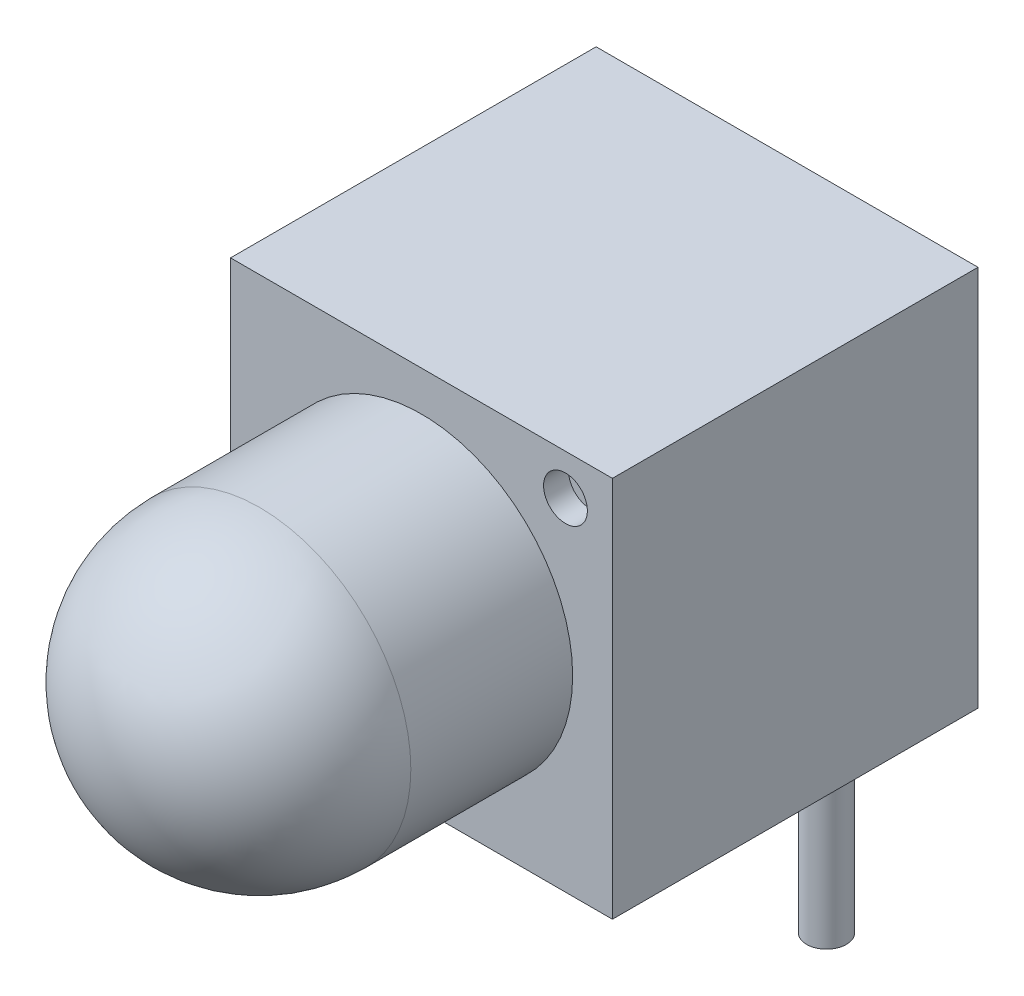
ISO-10303-21;
HEADER;
FILE_DESCRIPTION(('STEP AP214'),'2;1');
FILE_NAME('part.step','',(''),(''),'','','');
FILE_SCHEMA(('AUTOMOTIVE_DESIGN { 1 0 10303 214 1 1 1 1 }'));
ENDSEC;
DATA;
#1=APPLICATION_CONTEXT('core data for automotive mechanical design processes');
#2=APPLICATION_PROTOCOL_DEFINITION('international standard','automotive_design',2000,#1);
#3=PRODUCT_CONTEXT('',#1,'mechanical');
#4=PRODUCT('Part','Part','',(#3));
#5=PRODUCT_RELATED_PRODUCT_CATEGORY('part','',(#4));
#6=PRODUCT_DEFINITION_FORMATION('','',#4);
#7=PRODUCT_DEFINITION_CONTEXT('part definition',#1,'design');
#8=PRODUCT_DEFINITION('design','',#6,#7);
#9=PRODUCT_DEFINITION_SHAPE('','',#8);
#10=(LENGTH_UNIT() NAMED_UNIT(*) SI_UNIT(.MILLI.,.METRE.));
#11=(NAMED_UNIT(*) PLANE_ANGLE_UNIT() SI_UNIT($,.RADIAN.));
#12=(NAMED_UNIT(*) SI_UNIT($,.STERADIAN.) SOLID_ANGLE_UNIT());
#13=UNCERTAINTY_MEASURE_WITH_UNIT(LENGTH_MEASURE(1.E-05),#10,'distance_accuracy_value','');
#14=(GEOMETRIC_REPRESENTATION_CONTEXT(3) GLOBAL_UNCERTAINTY_ASSIGNED_CONTEXT((#13)) GLOBAL_UNIT_ASSIGNED_CONTEXT((#10,
#11,#12)) REPRESENTATION_CONTEXT('',''));
#15=CARTESIAN_POINT('',(0.,0.,0.));
#16=DIRECTION('',(0.,0.,1.));
#17=DIRECTION('',(1.,0.,0.));
#18=AXIS2_PLACEMENT_3D('',#15,#16,#17);
#19=CARTESIAN_POINT('',(-3.05,0.,-5.84));
#20=DIRECTION('',(0.,-1.,0.));
#21=DIRECTION('',(0.,0.,-1.));
#22=AXIS2_PLACEMENT_3D('',#19,#20,#21);
#23=PLANE('',#22);
#24=CARTESIAN_POINT('',(-1.27,0.,-5.2));
#25=DIRECTION('',(0.,-1.,0.));
#26=DIRECTION('',(0.,0.,-1.));
#27=AXIS2_PLACEMENT_3D('',#24,#25,#26);
#28=CIRCLE('',#27,0.3175);
#29=CARTESIAN_POINT('',(-1.27,0.,-5.5175));
#30=VERTEX_POINT('',#29);
#31=EDGE_CURVE('E144',#30,#30,#28,.T.);
#32=ORIENTED_EDGE('',*,*,#31,.F.);
#33=EDGE_LOOP('',(#32));
#34=FACE_BOUND('',#33,.T.);
#35=DIRECTION('',(0.,0.,1.));
#36=VECTOR('',#35,1.);
#37=CARTESIAN_POINT('',(-3.05,0.,0.));
#38=LINE('',#37,#36);
#39=CARTESIAN_POINT('',(-3.05,0.,-5.84));
#40=VERTEX_POINT('',#39);
#41=CARTESIAN_POINT('',(-3.05,0.,0.));
#42=VERTEX_POINT('',#41);
#43=EDGE_CURVE('E111',#40,#42,#38,.T.);
#44=ORIENTED_EDGE('',*,*,#43,.F.);
#45=DIRECTION('',(-1.,0.,0.));
#46=VECTOR('',#45,1.);
#47=CARTESIAN_POINT('',(-3.05,0.,-5.84));
#48=LINE('',#47,#46);
#49=CARTESIAN_POINT('',(3.05,0.,-5.84));
#50=VERTEX_POINT('',#49);
#51=EDGE_CURVE('E78',#50,#40,#48,.T.);
#52=ORIENTED_EDGE('',*,*,#51,.F.);
#53=DIRECTION('',(0.,0.,-1.));
#54=VECTOR('',#53,1.);
#55=CARTESIAN_POINT('',(3.05,0.,0.));
#56=LINE('',#55,#54);
#57=CARTESIAN_POINT('',(3.05,0.,0.));
#58=VERTEX_POINT('',#57);
#59=EDGE_CURVE('E72',#58,#50,#56,.T.);
#60=ORIENTED_EDGE('',*,*,#59,.F.);
#61=DIRECTION('',(1.,0.,0.));
#62=VECTOR('',#61,1.);
#63=CARTESIAN_POINT('',(-3.05,0.,0.));
#64=LINE('',#63,#62);
#65=EDGE_CURVE('E98',#42,#58,#64,.T.);
#66=ORIENTED_EDGE('',*,*,#65,.F.);
#67=EDGE_LOOP('',(#44,#52,#60,#66));
#68=FACE_BOUND('',#67,.T.);
#69=CARTESIAN_POINT('',(1.27,0.,-5.2));
#70=DIRECTION('',(0.,-1.,0.));
#71=DIRECTION('',(0.,0.,1.));
#72=AXIS2_PLACEMENT_3D('',#69,#70,#71);
#73=CIRCLE('',#72,0.3175);
#74=CARTESIAN_POINT('',(1.27,0.,-4.8825));
#75=VERTEX_POINT('',#74);
#76=EDGE_CURVE('E135',#75,#75,#73,.T.);
#77=ORIENTED_EDGE('',*,*,#76,.F.);
#78=EDGE_LOOP('',(#77));
#79=FACE_BOUND('',#78,.T.);
#80=ADVANCED_FACE('F37',(#34,#68,#79),#23,.T.);
#81=CARTESIAN_POINT('',(-3.05,6.1,0.));
#82=DIRECTION('',(0.,0.,-1.));
#83=DIRECTION('',(-1.,0.,0.));
#84=AXIS2_PLACEMENT_3D('',#81,#82,#83);
#85=PLANE('',#84);
#86=CARTESIAN_POINT('',(2.3,5.45,0.));
#87=DIRECTION('',(0.,0.,1.));
#88=DIRECTION('',(1.,0.,0.));
#89=AXIS2_PLACEMENT_3D('',#86,#87,#88);
#90=CIRCLE('',#89,0.350000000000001);
#91=CARTESIAN_POINT('',(2.65,5.45,0.));
#92=VERTEX_POINT('',#91);
#93=EDGE_CURVE('E148',#92,#92,#90,.T.);
#94=ORIENTED_EDGE('',*,*,#93,.F.);
#95=EDGE_LOOP('',(#94));
#96=FACE_BOUND('',#95,.T.);
#97=ORIENTED_EDGE('',*,*,#65,.T.);
#98=DIRECTION('',(0.,-1.,0.));
#99=VECTOR('',#98,1.);
#100=CARTESIAN_POINT('',(3.05,6.1,0.));
#101=LINE('',#100,#99);
#102=CARTESIAN_POINT('',(3.05,6.1,0.));
#103=VERTEX_POINT('',#102);
#104=EDGE_CURVE('E95',#103,#58,#101,.T.);
#105=ORIENTED_EDGE('',*,*,#104,.F.);
#106=DIRECTION('',(1.,0.,0.));
#107=VECTOR('',#106,1.);
#108=CARTESIAN_POINT('',(-3.05,6.1,0.));
#109=LINE('',#108,#107);
#110=CARTESIAN_POINT('',(-3.05,6.1,0.));
#111=VERTEX_POINT('',#110);
#112=EDGE_CURVE('E86',#111,#103,#109,.T.);
#113=ORIENTED_EDGE('',*,*,#112,.F.);
#114=DIRECTION('',(0.,-1.,0.));
#115=VECTOR('',#114,1.);
#116=CARTESIAN_POINT('',(-3.05,6.1,0.));
#117=LINE('',#116,#115);
#118=EDGE_CURVE('E47',#111,#42,#117,.T.);
#119=ORIENTED_EDGE('',*,*,#118,.T.);
#120=EDGE_LOOP('',(#97,#105,#113,#119));
#121=FACE_BOUND('',#120,.T.);
#122=CARTESIAN_POINT('',(0.,3.05,0.));
#123=DIRECTION('',(0.,0.,-1.));
#124=DIRECTION('',(-1.,0.,0.));
#125=AXIS2_PLACEMENT_3D('',#122,#123,#124);
#126=CIRCLE('',#125,2.415);
#127=CARTESIAN_POINT('',(-2.415,3.05,0.));
#128=VERTEX_POINT('',#127);
#129=EDGE_CURVE('E11',#128,#128,#126,.F.);
#130=ORIENTED_EDGE('',*,*,#129,.F.);
#131=EDGE_LOOP('',(#130));
#132=FACE_BOUND('',#131,.T.);
#133=ADVANCED_FACE('F96',(#96,#121,#132),#85,.F.);
#134=CARTESIAN_POINT('',(-3.05,6.1,0.));
#135=DIRECTION('',(1.,0.,0.));
#136=DIRECTION('',(0.,0.,-1.));
#137=AXIS2_PLACEMENT_3D('',#134,#135,#136);
#138=PLANE('',#137);
#139=ORIENTED_EDGE('',*,*,#43,.T.);
#140=ORIENTED_EDGE('',*,*,#118,.F.);
#141=DIRECTION('',(0.,0.,1.));
#142=VECTOR('',#141,1.);
#143=CARTESIAN_POINT('',(-3.05,6.1,0.));
#144=LINE('',#143,#142);
#145=CARTESIAN_POINT('',(-3.05,6.1,-5.84));
#146=VERTEX_POINT('',#145);
#147=EDGE_CURVE('E91',#146,#111,#144,.T.);
#148=ORIENTED_EDGE('',*,*,#147,.F.);
#149=DIRECTION('',(0.,-1.,0.));
#150=VECTOR('',#149,1.);
#151=CARTESIAN_POINT('',(-3.05,6.1,-5.84));
#152=LINE('',#151,#150);
#153=EDGE_CURVE('E107',#146,#40,#152,.T.);
#154=ORIENTED_EDGE('',*,*,#153,.T.);
#155=EDGE_LOOP('',(#139,#140,#148,#154));
#156=FACE_BOUND('',#155,.T.);
#157=ADVANCED_FACE('F39',(#156),#138,.F.);
#158=CARTESIAN_POINT('',(3.05,6.1,0.));
#159=DIRECTION('',(-1.,0.,0.));
#160=DIRECTION('',(0.,0.,1.));
#161=AXIS2_PLACEMENT_3D('',#158,#159,#160);
#162=PLANE('',#161);
#163=ORIENTED_EDGE('',*,*,#59,.T.);
#164=DIRECTION('',(0.,-1.,0.));
#165=VECTOR('',#164,1.);
#166=CARTESIAN_POINT('',(3.05,6.1,-5.84));
#167=LINE('',#166,#165);
#168=CARTESIAN_POINT('',(3.05,6.1,-5.84));
#169=VERTEX_POINT('',#168);
#170=EDGE_CURVE('E100',#169,#50,#167,.T.);
#171=ORIENTED_EDGE('',*,*,#170,.F.);
#172=DIRECTION('',(0.,0.,-1.));
#173=VECTOR('',#172,1.);
#174=CARTESIAN_POINT('',(3.05,6.1,0.));
#175=LINE('',#174,#173);
#176=EDGE_CURVE('E89',#103,#169,#175,.T.);
#177=ORIENTED_EDGE('',*,*,#176,.F.);
#178=ORIENTED_EDGE('',*,*,#104,.T.);
#179=EDGE_LOOP('',(#163,#171,#177,#178));
#180=FACE_BOUND('',#179,.T.);
#181=ADVANCED_FACE('F102',(#180),#162,.F.);
#182=CARTESIAN_POINT('',(-3.05,6.1,-5.84));
#183=DIRECTION('',(0.,0.,1.));
#184=DIRECTION('',(1.,0.,0.));
#185=AXIS2_PLACEMENT_3D('',#182,#183,#184);
#186=PLANE('',#185);
#187=ORIENTED_EDGE('',*,*,#51,.T.);
#188=ORIENTED_EDGE('',*,*,#153,.F.);
#189=DIRECTION('',(-1.,0.,0.));
#190=VECTOR('',#189,1.);
#191=CARTESIAN_POINT('',(-3.05,6.1,-5.84));
#192=LINE('',#191,#190);
#193=EDGE_CURVE('E55',#169,#146,#192,.T.);
#194=ORIENTED_EDGE('',*,*,#193,.F.);
#195=ORIENTED_EDGE('',*,*,#170,.T.);
#196=EDGE_LOOP('',(#187,#188,#194,#195));
#197=FACE_BOUND('',#196,.T.);
#198=ADVANCED_FACE('F178',(#197),#186,.F.);
#199=CARTESIAN_POINT('',(-3.05,6.1,-5.84));
#200=DIRECTION('',(0.,-1.,0.));
#201=DIRECTION('',(0.,0.,-1.));
#202=AXIS2_PLACEMENT_3D('',#199,#200,#201);
#203=PLANE('',#202);
#204=ORIENTED_EDGE('',*,*,#147,.T.);
#205=ORIENTED_EDGE('',*,*,#112,.T.);
#206=ORIENTED_EDGE('',*,*,#176,.T.);
#207=ORIENTED_EDGE('',*,*,#193,.T.);
#208=EDGE_LOOP('',(#204,#205,#206,#207));
#209=FACE_BOUND('',#208,.T.);
#210=ADVANCED_FACE('F87',(#209),#203,.F.);
#211=CARTESIAN_POINT('',(0.,3.05,5.));
#212=DIRECTION('',(0.,0.,1.));
#213=DIRECTION('',(1.,0.,0.));
#214=AXIS2_PLACEMENT_3D('',#211,#212,#213);
#215=CYLINDRICAL_SURFACE('',#214,2.415);
#216=CARTESIAN_POINT('',(0.,3.05,2.585));
#217=DIRECTION('',(0.,0.,1.));
#218=DIRECTION('',(1.,0.,0.));
#219=AXIS2_PLACEMENT_3D('',#216,#217,#218);
#220=CIRCLE('',#219,2.415);
#221=CARTESIAN_POINT('',(2.415,3.05,2.585));
#222=VERTEX_POINT('',#221);
#223=EDGE_CURVE('E115',#222,#222,#220,.T.);
#224=ORIENTED_EDGE('',*,*,#223,.F.);
#225=EDGE_LOOP('',(#224));
#226=FACE_BOUND('',#225,.T.);
#227=ORIENTED_EDGE('',*,*,#129,.T.);
#228=EDGE_LOOP('',(#227));
#229=FACE_BOUND('',#228,.T.);
#230=ADVANCED_FACE('F164',(#226,#229),#215,.T.);
#231=CARTESIAN_POINT('',(0.,3.05,2.585));
#232=DIRECTION('',(0.,0.,1.));
#233=DIRECTION('',(0.,1.,0.));
#234=AXIS2_PLACEMENT_3D('',#231,#232,#233);
#235=SPHERICAL_SURFACE('',#234,2.415);
#236=ORIENTED_EDGE('',*,*,#223,.T.);
#237=EDGE_LOOP('',(#236));
#238=FACE_BOUND('',#237,.T.);
#239=ADVANCED_FACE('F162',(#238),#235,.T.);
#240=CARTESIAN_POINT('',(-1.27,-3.68,-5.2));
#241=DIRECTION('',(0.,1.,0.));
#242=DIRECTION('',(0.,0.,1.));
#243=AXIS2_PLACEMENT_3D('',#240,#241,#242);
#244=CYLINDRICAL_SURFACE('',#243,0.3175);
#245=CARTESIAN_POINT('',(-1.27,-3.68,-5.2));
#246=DIRECTION('',(0.,-1.,0.));
#247=DIRECTION('',(0.,0.,-1.));
#248=AXIS2_PLACEMENT_3D('',#245,#246,#247);
#249=CIRCLE('',#248,0.3175);
#250=CARTESIAN_POINT('',(-1.27,-3.68,-5.5175));
#251=VERTEX_POINT('',#250);
#252=EDGE_CURVE('E152',#251,#251,#249,.T.);
#253=ORIENTED_EDGE('',*,*,#252,.F.);
#254=EDGE_LOOP('',(#253));
#255=FACE_BOUND('',#254,.T.);
#256=ORIENTED_EDGE('',*,*,#31,.T.);
#257=EDGE_LOOP('',(#256));
#258=FACE_BOUND('',#257,.T.);
#259=ADVANCED_FACE('F185',(#255,#258),#244,.T.);
#260=CARTESIAN_POINT('',(-1.27,-3.68,-5.2));
#261=DIRECTION('',(0.,-1.,0.));
#262=DIRECTION('',(0.,0.,-1.));
#263=AXIS2_PLACEMENT_3D('',#260,#261,#262);
#264=PLANE('',#263);
#265=ORIENTED_EDGE('',*,*,#252,.T.);
#266=EDGE_LOOP('',(#265));
#267=FACE_BOUND('',#266,.T.);
#268=ADVANCED_FACE('F188',(#267),#264,.T.);
#269=CARTESIAN_POINT('',(1.27,-3.68,-5.2));
#270=DIRECTION('',(0.,1.,0.));
#271=DIRECTION('',(0.,0.,1.));
#272=AXIS2_PLACEMENT_3D('',#269,#270,#271);
#273=CYLINDRICAL_SURFACE('',#272,0.3175);
#274=CARTESIAN_POINT('',(1.27,-3.68,-5.2));
#275=DIRECTION('',(0.,-1.,0.));
#276=DIRECTION('',(0.,0.,1.));
#277=AXIS2_PLACEMENT_3D('',#274,#275,#276);
#278=CIRCLE('',#277,0.3175);
#279=CARTESIAN_POINT('',(1.27,-3.68,-4.8825));
#280=VERTEX_POINT('',#279);
#281=EDGE_CURVE('E138',#280,#280,#278,.T.);
#282=ORIENTED_EDGE('',*,*,#281,.F.);
#283=EDGE_LOOP('',(#282));
#284=FACE_BOUND('',#283,.T.);
#285=ORIENTED_EDGE('',*,*,#76,.T.);
#286=EDGE_LOOP('',(#285));
#287=FACE_BOUND('',#286,.T.);
#288=ADVANCED_FACE('F192',(#284,#287),#273,.T.);
#289=CARTESIAN_POINT('',(1.27,-3.68,-5.2));
#290=DIRECTION('',(0.,1.,0.));
#291=DIRECTION('',(0.,0.,1.));
#292=AXIS2_PLACEMENT_3D('',#289,#290,#291);
#293=PLANE('',#292);
#294=ORIENTED_EDGE('',*,*,#281,.T.);
#295=EDGE_LOOP('',(#294));
#296=FACE_BOUND('',#295,.T.);
#297=ADVANCED_FACE('F196',(#296),#293,.F.);
#298=CARTESIAN_POINT('',(2.3,5.45,-0.4));
#299=DIRECTION('',(0.,0.,1.));
#300=DIRECTION('',(1.,0.,0.));
#301=AXIS2_PLACEMENT_3D('',#298,#299,#300);
#302=CYLINDRICAL_SURFACE('',#301,0.350000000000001);
#303=CARTESIAN_POINT('',(2.3,5.45,-0.4));
#304=DIRECTION('',(0.,0.,1.));
#305=DIRECTION('',(1.,0.,0.));
#306=AXIS2_PLACEMENT_3D('',#303,#304,#305);
#307=CIRCLE('',#306,0.350000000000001);
#308=CARTESIAN_POINT('',(2.65,5.45,-0.4));
#309=VERTEX_POINT('',#308);
#310=EDGE_CURVE('E139',#309,#309,#307,.T.);
#311=ORIENTED_EDGE('',*,*,#310,.F.);
#312=EDGE_LOOP('',(#311));
#313=FACE_BOUND('',#312,.T.);
#314=ORIENTED_EDGE('',*,*,#93,.T.);
#315=EDGE_LOOP('',(#314));
#316=FACE_BOUND('',#315,.T.);
#317=ADVANCED_FACE('F200',(#313,#316),#302,.F.);
#318=CARTESIAN_POINT('',(2.3,5.45,-0.4));
#319=DIRECTION('',(0.,0.,1.));
#320=DIRECTION('',(1.,0.,0.));
#321=AXIS2_PLACEMENT_3D('',#318,#319,#320);
#322=PLANE('',#321);
#323=ORIENTED_EDGE('',*,*,#310,.T.);
#324=EDGE_LOOP('',(#323));
#325=FACE_BOUND('',#324,.T.);
#326=ADVANCED_FACE('F204',(#325),#322,.T.);
#327=CLOSED_SHELL('',(#80,#133,#157,#181,#198,#210,#230,#239,#259,#268,#288,#297,#317,#326));
#328=MANIFOLD_SOLID_BREP('B2',#327);
#329=ADVANCED_BREP_SHAPE_REPRESENTATION('',(#18,#328),#14);
#330=SHAPE_DEFINITION_REPRESENTATION(#9,#329);
ENDSEC;
END-ISO-10303-21;
